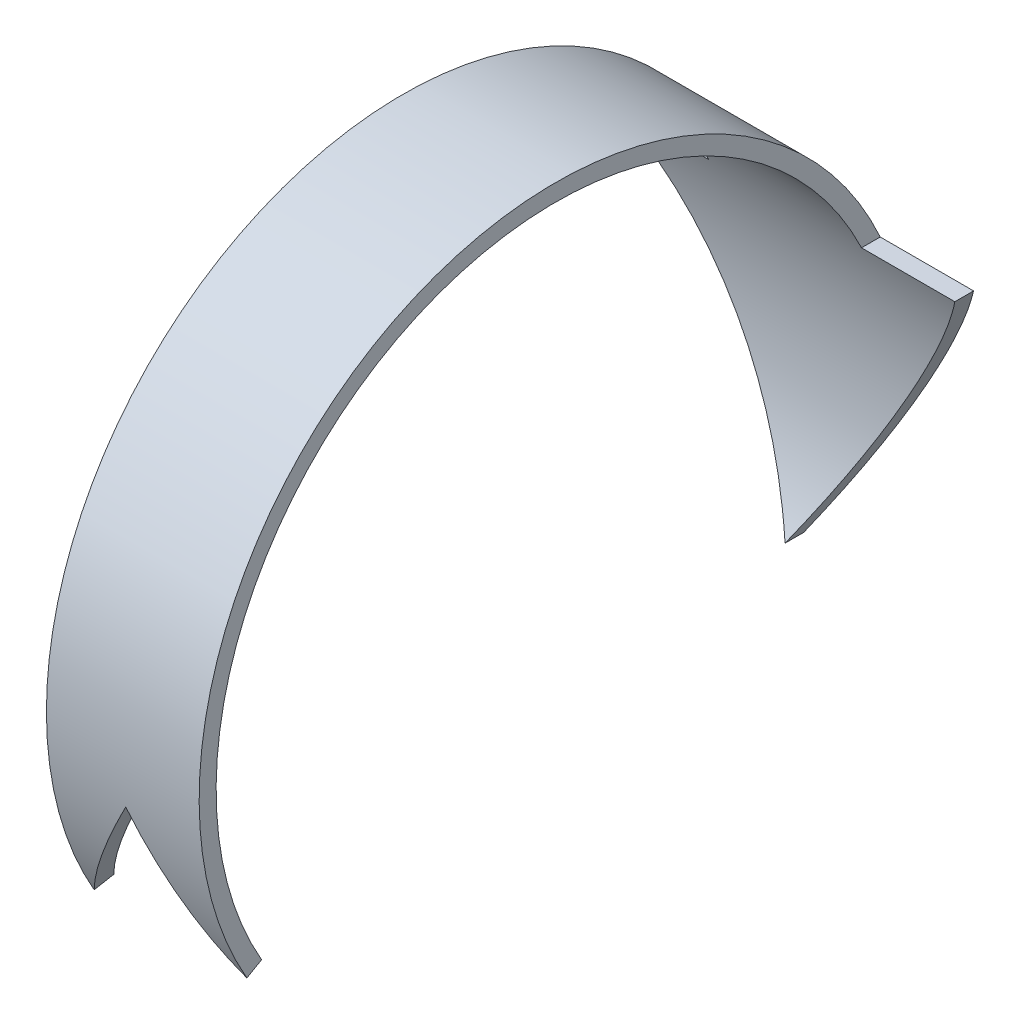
from build123d import *

# Parameters (mm, degrees)
CIRCULARBAND_W               = 15
CIRCULARBAND_H               = 0.75
BASE_REVOLVE_ANGLE           = 120
BASE_REVOLVE_OTHER_WAY_ANGLE = 120
SKETCH9_OUTSIDE_W            = 25.428
SKETCH9_OUTSIDE_H            = 34.053
HEAD1_DEPTH                  = 24.502659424
SKETCH10_OUTSIDE_W           = 25.428
SKETCH10_OUTSIDE_H           = 34.053
TAIL1_DEPTH                  = 24.502659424


with BuildPart() as part:
    # circularband → Base-Revolve (revolve)
    with BuildSketch(Plane.XY):
        with Locations((0, 15.375)):
            Rectangle(CIRCULARBAND_W, CIRCULARBAND_H)
    revolve(axis=Axis((0, 0, 0), (1, 0, 0)), revolution_arc=BASE_REVOLVE_ANGLE)

    # circularband → Base-Revolve other way (revolve)
    with BuildSketch(Plane.XY):
        with Locations((0, 15.375)):
            Rectangle(CIRCULARBAND_W, CIRCULARBAND_H)
    revolve(axis=Axis((0, 0, 0), (-1, 0, 0)), revolution_arc=BASE_REVOLVE_OTHER_WAY_ANGLE)

    # Sketch9 outside → head1 (cut, through all)
    with BuildSketch(Plane.XY):
        with Locations((0, 3.9375)):
            Rectangle(SKETCH9_OUTSIDE_W, SKETCH9_OUTSIDE_H)
        Polygon((-3.375, 15.75), (3.375, 15.75), (3.375, 6.490381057), (7.5, 6.490381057), (0, -6.5), (-7.5, 6.490381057), (-3.375, 6.490381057), align=None, mode=Mode.SUBTRACT)
    extrude(amount=-HEAD1_DEPTH, mode=Mode.SUBTRACT)

    # Sketch10 outside → tail1 (cut, through all)
    with BuildSketch(Plane.XY):
        with Locations((0, 3.9375)):
            Rectangle(SKETCH10_OUTSIDE_W, SKETCH10_OUTSIDE_H)
        Polygon((0, -2.029328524), (3.375, -7.875), (3.375, 15.75), (-3.375, 15.75), (-3.375, -7.875), align=None, mode=Mode.SUBTRACT)
    extrude(amount=TAIL1_DEPTH, mode=Mode.SUBTRACT)


solid = part.part
